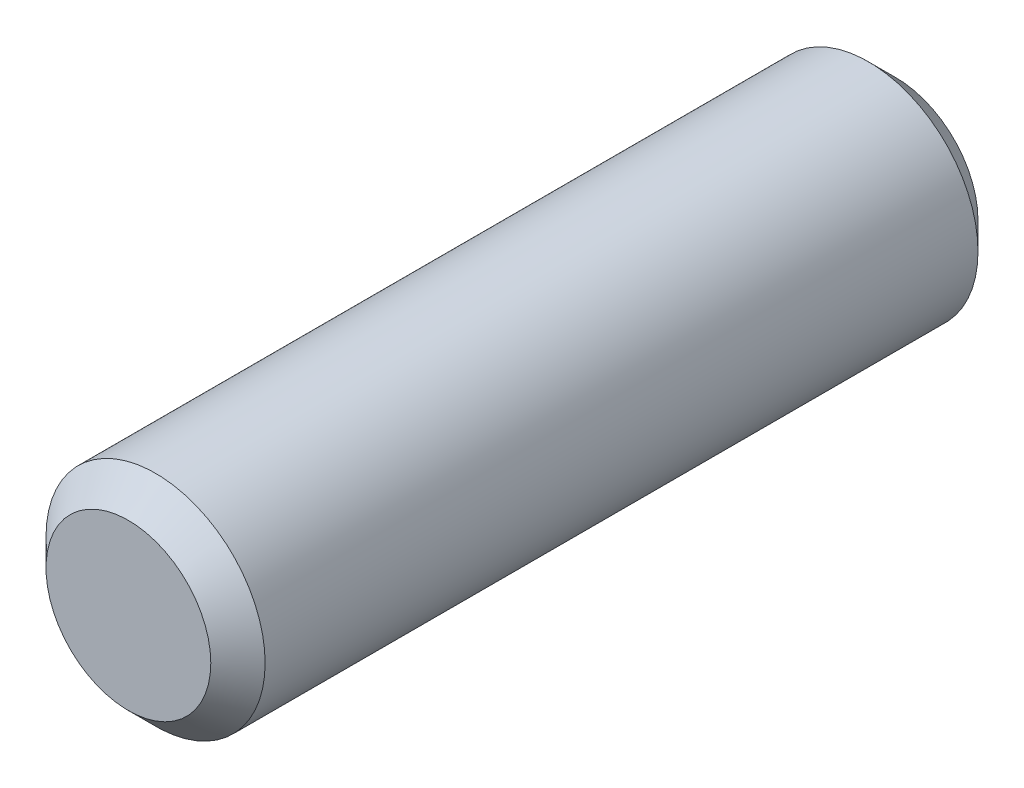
ISO-10303-21;
HEADER;
FILE_DESCRIPTION(('STEP AP214'),'2;1');
FILE_NAME('part.step','',(''),(''),'','','');
FILE_SCHEMA(('AUTOMOTIVE_DESIGN { 1 0 10303 214 1 1 1 1 }'));
ENDSEC;
DATA;
#1=APPLICATION_CONTEXT('core data for automotive mechanical design processes');
#2=APPLICATION_PROTOCOL_DEFINITION('international standard','automotive_design',2000,#1);
#3=PRODUCT_CONTEXT('',#1,'mechanical');
#4=PRODUCT('Part','Part','',(#3));
#5=PRODUCT_RELATED_PRODUCT_CATEGORY('part','',(#4));
#6=PRODUCT_DEFINITION_FORMATION('','',#4);
#7=PRODUCT_DEFINITION_CONTEXT('part definition',#1,'design');
#8=PRODUCT_DEFINITION('design','',#6,#7);
#9=PRODUCT_DEFINITION_SHAPE('','',#8);
#10=(LENGTH_UNIT() NAMED_UNIT(*) SI_UNIT(.MILLI.,.METRE.));
#11=(NAMED_UNIT(*) PLANE_ANGLE_UNIT() SI_UNIT($,.RADIAN.));
#12=(NAMED_UNIT(*) SI_UNIT($,.STERADIAN.) SOLID_ANGLE_UNIT());
#13=UNCERTAINTY_MEASURE_WITH_UNIT(LENGTH_MEASURE(1.E-05),#10,'distance_accuracy_value','');
#14=(GEOMETRIC_REPRESENTATION_CONTEXT(3) GLOBAL_UNCERTAINTY_ASSIGNED_CONTEXT((#13)) GLOBAL_UNIT_ASSIGNED_CONTEXT((#10,
#11,#12)) REPRESENTATION_CONTEXT('',''));
#15=CARTESIAN_POINT('',(0.,0.,0.));
#16=DIRECTION('',(0.,0.,1.));
#17=DIRECTION('',(1.,0.,0.));
#18=AXIS2_PLACEMENT_3D('',#15,#16,#17);
#19=CARTESIAN_POINT('',(0.,0.,29.6418));
#20=DIRECTION('',(0.,0.,-1.));
#21=DIRECTION('',(-1.,0.,0.));
#22=AXIS2_PLACEMENT_3D('',#19,#20,#21);
#23=CYLINDRICAL_SURFACE('',#22,4.2333333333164);
#24=CARTESIAN_POINT('',(0.,0.,1.04986666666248));
#25=DIRECTION('',(0.,0.,1.));
#26=DIRECTION('',(1.,0.,0.));
#27=AXIS2_PLACEMENT_3D('',#24,#25,#26);
#28=CIRCLE('',#27,4.2333333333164);
#29=CARTESIAN_POINT('',(4.2333333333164,0.,1.04986666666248));
#30=VERTEX_POINT('',#29);
#31=EDGE_CURVE('E39',#30,#30,#28,.T.);
#32=ORIENTED_EDGE('',*,*,#31,.T.);
#33=EDGE_LOOP('',(#32));
#34=FACE_BOUND('',#33,.T.);
#35=CARTESIAN_POINT('',(0.,0.,28.5919333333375));
#36=DIRECTION('',(0.,0.,1.));
#37=DIRECTION('',(1.,0.,0.));
#38=AXIS2_PLACEMENT_3D('',#35,#36,#37);
#39=CIRCLE('',#38,4.2333333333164);
#40=CARTESIAN_POINT('',(4.2333333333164,0.,28.5919333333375));
#41=VERTEX_POINT('',#40);
#42=EDGE_CURVE('E43',#41,#41,#39,.F.);
#43=ORIENTED_EDGE('',*,*,#42,.T.);
#44=EDGE_LOOP('',(#43));
#45=FACE_BOUND('',#44,.T.);
#46=ADVANCED_FACE('F28',(#34,#45),#23,.T.);
#47=CARTESIAN_POINT('',(0.,0.,29.6418));
#48=DIRECTION('',(0.,0.,1.));
#49=DIRECTION('',(1.,0.,0.));
#50=AXIS2_PLACEMENT_3D('',#47,#48,#49);
#51=PLANE('',#50);
#52=CARTESIAN_POINT('',(0.,0.,29.6418));
#53=DIRECTION('',(0.,0.,1.));
#54=DIRECTION('',(1.,0.,0.));
#55=AXIS2_PLACEMENT_3D('',#52,#53,#54);
#56=CIRCLE('',#55,3.18346666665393);
#57=CARTESIAN_POINT('',(3.18346666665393,0.,29.6418));
#58=VERTEX_POINT('',#57);
#59=EDGE_CURVE('E10',#58,#58,#56,.T.);
#60=ORIENTED_EDGE('',*,*,#59,.T.);
#61=EDGE_LOOP('',(#60));
#62=FACE_BOUND('',#61,.T.);
#63=ADVANCED_FACE('F59',(#62),#51,.T.);
#64=CARTESIAN_POINT('',(0.,0.,0.));
#65=DIRECTION('',(0.,0.,1.));
#66=DIRECTION('',(1.,0.,0.));
#67=AXIS2_PLACEMENT_3D('',#64,#65,#66);
#68=PLANE('',#67);
#69=CARTESIAN_POINT('',(0.,0.,0.));
#70=DIRECTION('',(0.,0.,1.));
#71=DIRECTION('',(1.,0.,0.));
#72=AXIS2_PLACEMENT_3D('',#69,#70,#71);
#73=CIRCLE('',#72,3.18346666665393);
#74=CARTESIAN_POINT('',(3.18346666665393,0.,0.));
#75=VERTEX_POINT('',#74);
#76=EDGE_CURVE('E35',#75,#75,#73,.F.);
#77=ORIENTED_EDGE('',*,*,#76,.T.);
#78=EDGE_LOOP('',(#77));
#79=FACE_BOUND('',#78,.T.);
#80=ADVANCED_FACE('F56',(#79),#68,.F.);
#81=CARTESIAN_POINT('',(0.,0.,1.04986666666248));
#82=DIRECTION('',(0.,0.,1.));
#83=DIRECTION('',(1.,0.,0.));
#84=AXIS2_PLACEMENT_3D('',#81,#82,#83);
#85=CONICAL_SURFACE('',#84,4.2333333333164,0.785398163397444);
#86=ORIENTED_EDGE('',*,*,#76,.F.);
#87=EDGE_LOOP('',(#86));
#88=FACE_BOUND('',#87,.T.);
#89=ORIENTED_EDGE('',*,*,#31,.F.);
#90=EDGE_LOOP('',(#89));
#91=FACE_BOUND('',#90,.T.);
#92=ADVANCED_FACE('F52',(#88,#91),#85,.T.);
#93=CARTESIAN_POINT('',(0.,0.,29.6418));
#94=DIRECTION('',(0.,0.,-1.));
#95=DIRECTION('',(-1.,0.,0.));
#96=AXIS2_PLACEMENT_3D('',#93,#94,#95);
#97=CONICAL_SURFACE('',#96,3.18346666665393,0.785398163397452);
#98=ORIENTED_EDGE('',*,*,#42,.F.);
#99=EDGE_LOOP('',(#98));
#100=FACE_BOUND('',#99,.T.);
#101=ORIENTED_EDGE('',*,*,#59,.F.);
#102=EDGE_LOOP('',(#101));
#103=FACE_BOUND('',#102,.T.);
#104=ADVANCED_FACE('F30',(#100,#103),#97,.T.);
#105=CLOSED_SHELL('',(#46,#63,#80,#92,#104));
#106=MANIFOLD_SOLID_BREP('B2',#105);
#107=ADVANCED_BREP_SHAPE_REPRESENTATION('',(#18,#106),#14);
#108=SHAPE_DEFINITION_REPRESENTATION(#9,#107);
ENDSEC;
END-ISO-10303-21;
